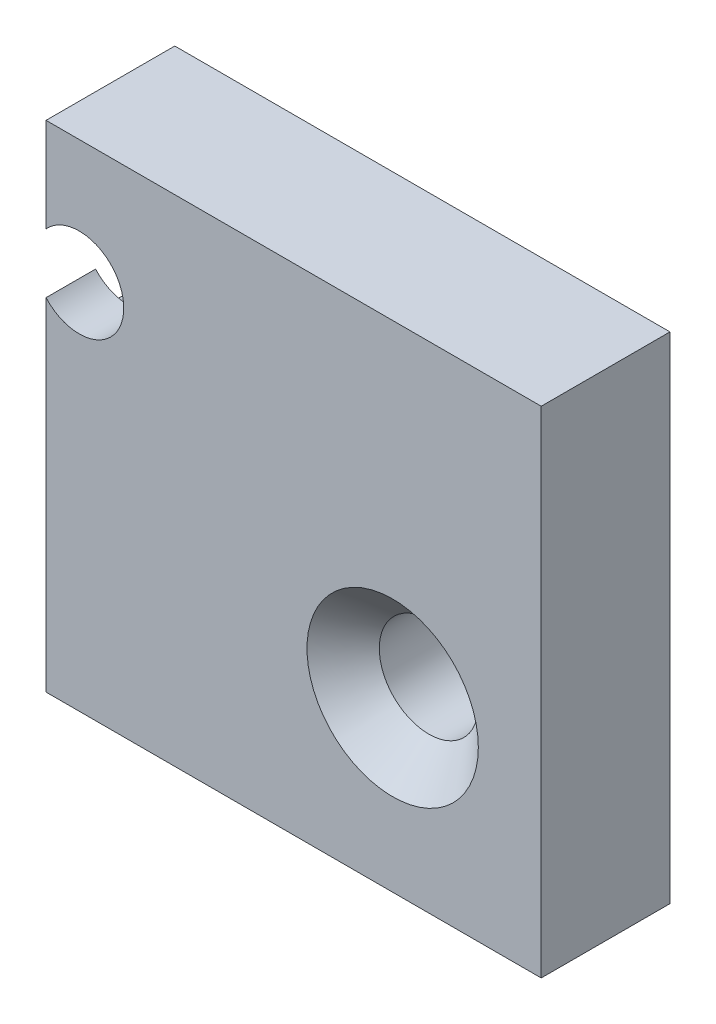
from build123d import *

# Parameters (mm, degrees)
SKIZZE1_W                                            = 50
SKIZZE1_H                                            = 50
LINEAR_AUSTRAGEN1_DEPTH                              = 13
FORMSENKUNG_F_R_M8_LINSENSENKSCHRAUBE_MI_D           = 10
FORMSENKUNG_F_R_M8_LINSENSENKSCHRAUBE_MI_CSINK_D     = 17.3
FORMSENKUNG_F_R_M8_LINSENSENKSCHRAUBE_MI_CSINK_ANGLE = 90
STIRNSENKUNG_F_R_M8_ZYLINDERSCHRAUBE_MIT_D           = 9
STIRNSENKUNG_F_R_M8_ZYLINDERSCHRAUBE_MIT_CBORE_D     = 15
STIRNSENKUNG_F_R_M8_ZYLINDERSCHRAUBE_MIT_CBORE_DEPTH = 8


with BuildPart() as part:
    # Skizze1 → Linear austragen1 (new body)
    with BuildSketch(Plane.XY):
        Rectangle(SKIZZE1_W, SKIZZE1_H)
    extrude(amount=LINEAR_AUSTRAGEN1_DEPTH)

    # Formsenkung f_r M8 Linsensenkschraube mi (through all)
    with Locations(Plane.XY.offset(13)):
        with Locations((10, -8)):
            CounterSinkHole(FORMSENKUNG_F_R_M8_LINSENSENKSCHRAUBE_MI_D / 2, FORMSENKUNG_F_R_M8_LINSENSENKSCHRAUBE_MI_CSINK_D / 2, counter_sink_angle=FORMSENKUNG_F_R_M8_LINSENSENKSCHRAUBE_MI_CSINK_ANGLE)

    # Stirnsenkung f_r M8 Zylinderschraube mit (through all)
    with Locations(Plane(origin=(0, 0, 0), x_dir=(-1, 0, 0), z_dir=(0, 0, -1))):
        with Locations((21.650635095, 12.5)):
            CounterBoreHole(STIRNSENKUNG_F_R_M8_ZYLINDERSCHRAUBE_MIT_D / 2, STIRNSENKUNG_F_R_M8_ZYLINDERSCHRAUBE_MIT_CBORE_D / 2, STIRNSENKUNG_F_R_M8_ZYLINDERSCHRAUBE_MIT_CBORE_DEPTH)


solid = part.part
